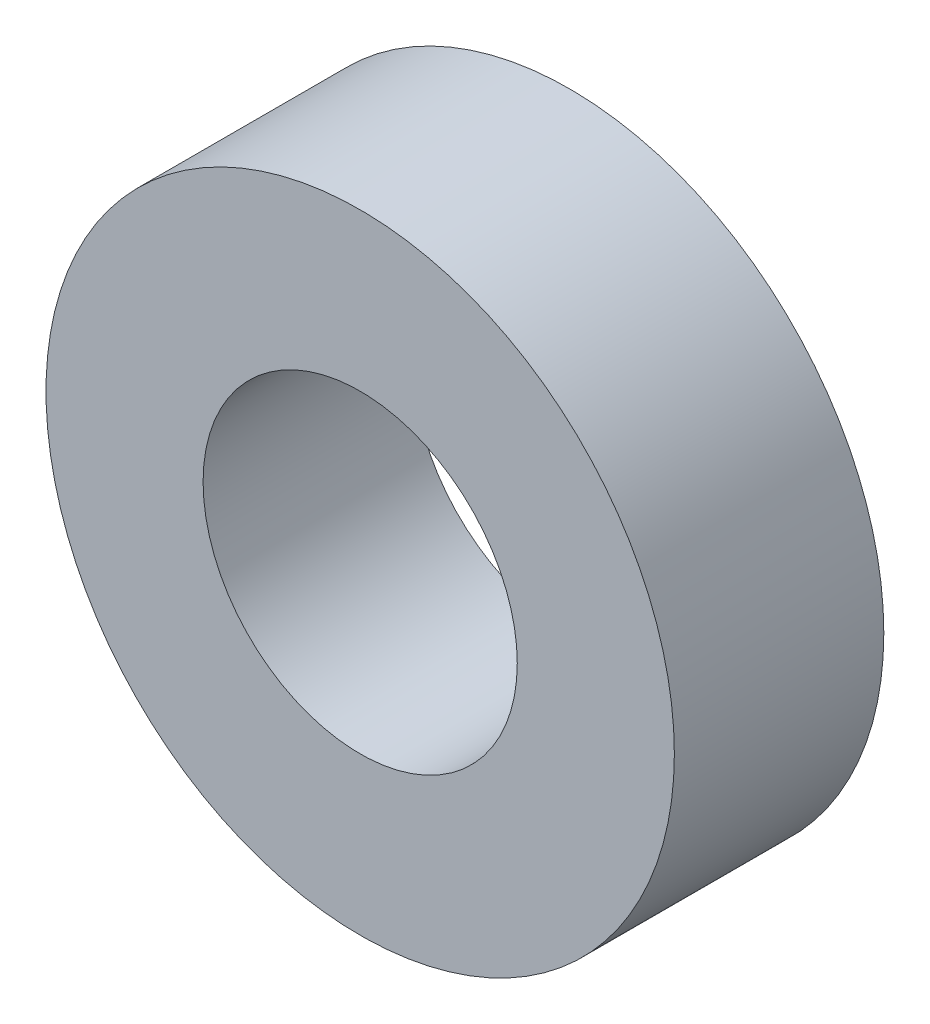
ISO-10303-21;
HEADER;
FILE_DESCRIPTION(('STEP AP214'),'2;1');
FILE_NAME('part.step','',(''),(''),'','','');
FILE_SCHEMA(('AUTOMOTIVE_DESIGN { 1 0 10303 214 1 1 1 1 }'));
ENDSEC;
DATA;
#1=APPLICATION_CONTEXT('core data for automotive mechanical design processes');
#2=APPLICATION_PROTOCOL_DEFINITION('international standard','automotive_design',2000,#1);
#3=PRODUCT_CONTEXT('',#1,'mechanical');
#4=PRODUCT('Part','Part','',(#3));
#5=PRODUCT_RELATED_PRODUCT_CATEGORY('part','',(#4));
#6=PRODUCT_DEFINITION_FORMATION('','',#4);
#7=PRODUCT_DEFINITION_CONTEXT('part definition',#1,'design');
#8=PRODUCT_DEFINITION('design','',#6,#7);
#9=PRODUCT_DEFINITION_SHAPE('','',#8);
#10=(LENGTH_UNIT() NAMED_UNIT(*) SI_UNIT(.MILLI.,.METRE.));
#11=(NAMED_UNIT(*) PLANE_ANGLE_UNIT() SI_UNIT($,.RADIAN.));
#12=(NAMED_UNIT(*) SI_UNIT($,.STERADIAN.) SOLID_ANGLE_UNIT());
#13=UNCERTAINTY_MEASURE_WITH_UNIT(LENGTH_MEASURE(1.E-05),#10,'distance_accuracy_value','');
#14=(GEOMETRIC_REPRESENTATION_CONTEXT(3) GLOBAL_UNCERTAINTY_ASSIGNED_CONTEXT((#13)) GLOBAL_UNIT_ASSIGNED_CONTEXT((#10,
#11,#12)) REPRESENTATION_CONTEXT('',''));
#15=CARTESIAN_POINT('',(0.,0.,0.));
#16=DIRECTION('',(0.,0.,1.));
#17=DIRECTION('',(1.,0.,0.));
#18=AXIS2_PLACEMENT_3D('',#15,#16,#17);
#19=CARTESIAN_POINT('',(0.,0.,10.));
#20=DIRECTION('',(0.,0.,-1.));
#21=DIRECTION('',(-1.,0.,0.));
#22=AXIS2_PLACEMENT_3D('',#19,#20,#21);
#23=CYLINDRICAL_SURFACE('',#22,7.5);
#24=CARTESIAN_POINT('',(0.,0.,10.));
#25=DIRECTION('',(0.,0.,1.));
#26=DIRECTION('',(1.,0.,0.));
#27=AXIS2_PLACEMENT_3D('',#24,#25,#26);
#28=CIRCLE('',#27,7.5);
#29=CARTESIAN_POINT('',(7.5,0.,10.));
#30=VERTEX_POINT('',#29);
#31=EDGE_CURVE('E39',#30,#30,#28,.T.);
#32=ORIENTED_EDGE('',*,*,#31,.T.);
#33=EDGE_LOOP('',(#32));
#34=FACE_BOUND('',#33,.T.);
#35=CARTESIAN_POINT('',(0.,0.,0.));
#36=DIRECTION('',(0.,0.,1.));
#37=DIRECTION('',(1.,0.,0.));
#38=AXIS2_PLACEMENT_3D('',#35,#36,#37);
#39=CIRCLE('',#38,7.5);
#40=CARTESIAN_POINT('',(7.5,0.,0.));
#41=VERTEX_POINT('',#40);
#42=EDGE_CURVE('E45',#41,#41,#39,.T.);
#43=ORIENTED_EDGE('',*,*,#42,.F.);
#44=EDGE_LOOP('',(#43));
#45=FACE_BOUND('',#44,.T.);
#46=ADVANCED_FACE('F32',(#34,#45),#23,.F.);
#47=CARTESIAN_POINT('',(0.,0.,10.));
#48=DIRECTION('',(0.,0.,-1.));
#49=DIRECTION('',(-1.,0.,0.));
#50=AXIS2_PLACEMENT_3D('',#47,#48,#49);
#51=CYLINDRICAL_SURFACE('',#50,15.);
#52=CARTESIAN_POINT('',(0.,0.,10.));
#53=DIRECTION('',(0.,0.,1.));
#54=DIRECTION('',(1.,0.,0.));
#55=AXIS2_PLACEMENT_3D('',#52,#53,#54);
#56=CIRCLE('',#55,15.);
#57=CARTESIAN_POINT('',(15.,0.,10.));
#58=VERTEX_POINT('',#57);
#59=EDGE_CURVE('E10',#58,#58,#56,.T.);
#60=ORIENTED_EDGE('',*,*,#59,.F.);
#61=EDGE_LOOP('',(#60));
#62=FACE_BOUND('',#61,.T.);
#63=CARTESIAN_POINT('',(0.,0.,0.));
#64=DIRECTION('',(0.,0.,1.));
#65=DIRECTION('',(1.,0.,0.));
#66=AXIS2_PLACEMENT_3D('',#63,#64,#65);
#67=CIRCLE('',#66,15.);
#68=CARTESIAN_POINT('',(15.,0.,0.));
#69=VERTEX_POINT('',#68);
#70=EDGE_CURVE('E35',#69,#69,#67,.T.);
#71=ORIENTED_EDGE('',*,*,#70,.T.);
#72=EDGE_LOOP('',(#71));
#73=FACE_BOUND('',#72,.T.);
#74=ADVANCED_FACE('F52',(#62,#73),#51,.T.);
#75=CARTESIAN_POINT('',(0.,-33.1414213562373,10.));
#76=DIRECTION('',(0.,0.,1.));
#77=DIRECTION('',(1.,0.,0.));
#78=AXIS2_PLACEMENT_3D('',#75,#76,#77);
#79=PLANE('',#78);
#80=ORIENTED_EDGE('',*,*,#31,.F.);
#81=EDGE_LOOP('',(#80));
#82=FACE_BOUND('',#81,.T.);
#83=ORIENTED_EDGE('',*,*,#59,.T.);
#84=EDGE_LOOP('',(#83));
#85=FACE_BOUND('',#84,.T.);
#86=ADVANCED_FACE('F56',(#82,#85),#79,.T.);
#87=CARTESIAN_POINT('',(0.,-33.1414213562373,0.));
#88=DIRECTION('',(0.,0.,1.));
#89=DIRECTION('',(1.,0.,0.));
#90=AXIS2_PLACEMENT_3D('',#87,#88,#89);
#91=PLANE('',#90);
#92=ORIENTED_EDGE('',*,*,#42,.T.);
#93=EDGE_LOOP('',(#92));
#94=FACE_BOUND('',#93,.T.);
#95=ORIENTED_EDGE('',*,*,#70,.F.);
#96=EDGE_LOOP('',(#95));
#97=FACE_BOUND('',#96,.T.);
#98=ADVANCED_FACE('F54',(#94,#97),#91,.F.);
#99=CLOSED_SHELL('',(#46,#74,#86,#98));
#100=MANIFOLD_SOLID_BREP('B2',#99);
#101=ADVANCED_BREP_SHAPE_REPRESENTATION('',(#18,#100),#14);
#102=SHAPE_DEFINITION_REPRESENTATION(#9,#101);
ENDSEC;
END-ISO-10303-21;
